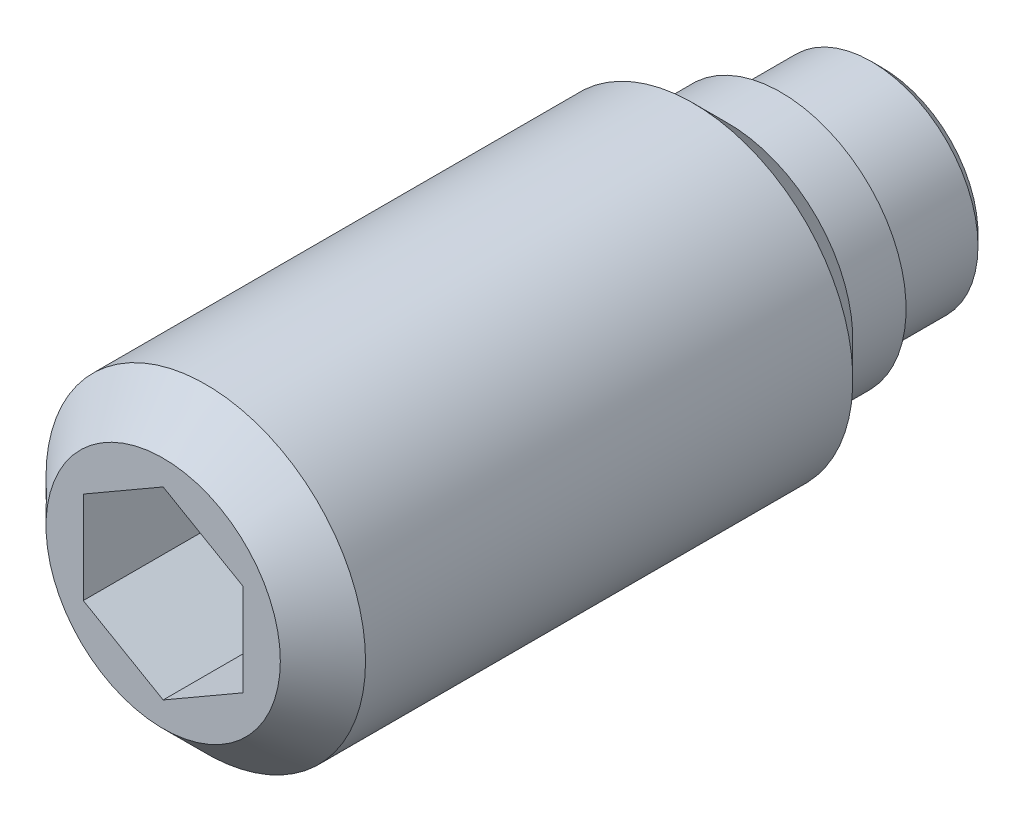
ISO-10303-21;
HEADER;
FILE_DESCRIPTION(('STEP AP214'),'2;1');
FILE_NAME('part.step','',(''),(''),'','','');
FILE_SCHEMA(('AUTOMOTIVE_DESIGN { 1 0 10303 214 1 1 1 1 }'));
ENDSEC;
DATA;
#1=APPLICATION_CONTEXT('core data for automotive mechanical design processes');
#2=APPLICATION_PROTOCOL_DEFINITION('international standard','automotive_design',2000,#1);
#3=PRODUCT_CONTEXT('',#1,'mechanical');
#4=PRODUCT('Part','Part','',(#3));
#5=PRODUCT_RELATED_PRODUCT_CATEGORY('part','',(#4));
#6=PRODUCT_DEFINITION_FORMATION('','',#4);
#7=PRODUCT_DEFINITION_CONTEXT('part definition',#1,'design');
#8=PRODUCT_DEFINITION('design','',#6,#7);
#9=PRODUCT_DEFINITION_SHAPE('','',#8);
#10=(LENGTH_UNIT() NAMED_UNIT(*) SI_UNIT(.MILLI.,.METRE.));
#11=(NAMED_UNIT(*) PLANE_ANGLE_UNIT() SI_UNIT($,.RADIAN.));
#12=(NAMED_UNIT(*) SI_UNIT($,.STERADIAN.) SOLID_ANGLE_UNIT());
#13=UNCERTAINTY_MEASURE_WITH_UNIT(LENGTH_MEASURE(1.E-05),#10,'distance_accuracy_value','');
#14=(GEOMETRIC_REPRESENTATION_CONTEXT(3) GLOBAL_UNCERTAINTY_ASSIGNED_CONTEXT((#13)) GLOBAL_UNIT_ASSIGNED_CONTEXT((#10,
#11,#12)) REPRESENTATION_CONTEXT('',''));
#15=CARTESIAN_POINT('',(0.,0.,0.));
#16=DIRECTION('',(0.,0.,1.));
#17=DIRECTION('',(1.,0.,0.));
#18=AXIS2_PLACEMENT_3D('',#15,#16,#17);
#19=CARTESIAN_POINT('',(0.,0.,1.9));
#20=DIRECTION('',(0.,0.,-1.));
#21=DIRECTION('',(-1.,0.,0.));
#22=AXIS2_PLACEMENT_3D('',#19,#20,#21);
#23=CYLINDRICAL_SURFACE('',#22,3.);
#24=CARTESIAN_POINT('',(0.,0.,12.7));
#25=DIRECTION('',(0.,0.,1.));
#26=DIRECTION('',(1.,0.,0.));
#27=AXIS2_PLACEMENT_3D('',#24,#25,#26);
#28=CIRCLE('',#27,3.);
#29=CARTESIAN_POINT('',(3.,0.,12.7));
#30=VERTEX_POINT('',#29);
#31=EDGE_CURVE('E9',#30,#30,#28,.F.);
#32=ORIENTED_EDGE('',*,*,#31,.T.);
#33=EDGE_LOOP('',(#32));
#34=FACE_BOUND('',#33,.T.);
#35=CARTESIAN_POINT('',(0.,0.,3.55));
#36=DIRECTION('',(0.,0.,-1.));
#37=DIRECTION('',(-1.,0.,0.));
#38=AXIS2_PLACEMENT_3D('',#35,#36,#37);
#39=CIRCLE('',#38,3.);
#40=CARTESIAN_POINT('',(-3.,0.,3.55));
#41=VERTEX_POINT('',#40);
#42=EDGE_CURVE('E74',#41,#41,#39,.T.);
#43=ORIENTED_EDGE('',*,*,#42,.F.);
#44=EDGE_LOOP('',(#43));
#45=FACE_BOUND('',#44,.T.);
#46=ADVANCED_FACE('F14',(#34,#45),#23,.T.);
#47=CARTESIAN_POINT('',(0.,0.,3.55));
#48=DIRECTION('',(0.,0.,1.));
#49=DIRECTION('',(1.,0.,0.));
#50=AXIS2_PLACEMENT_3D('',#47,#48,#49);
#51=CONICAL_SURFACE('',#50,3.,0.785398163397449);
#52=ORIENTED_EDGE('',*,*,#42,.T.);
#53=EDGE_LOOP('',(#52));
#54=FACE_BOUND('',#53,.T.);
#55=CARTESIAN_POINT('',(0.,0.,2.9));
#56=DIRECTION('',(0.,0.,-1.));
#57=DIRECTION('',(-1.,0.,0.));
#58=AXIS2_PLACEMENT_3D('',#55,#56,#57);
#59=CIRCLE('',#58,2.35);
#60=CARTESIAN_POINT('',(-2.35,0.,2.9));
#61=VERTEX_POINT('',#60);
#62=EDGE_CURVE('E112',#61,#61,#59,.T.);
#63=ORIENTED_EDGE('',*,*,#62,.F.);
#64=EDGE_LOOP('',(#63));
#65=FACE_BOUND('',#64,.T.);
#66=ADVANCED_FACE('F130',(#54,#65),#51,.T.);
#67=CARTESIAN_POINT('',(0.,0.,1.9));
#68=DIRECTION('',(0.,0.,-1.));
#69=DIRECTION('',(-1.,0.,0.));
#70=AXIS2_PLACEMENT_3D('',#67,#68,#69);
#71=CYLINDRICAL_SURFACE('',#70,2.35);
#72=ORIENTED_EDGE('',*,*,#62,.T.);
#73=EDGE_LOOP('',(#72));
#74=FACE_BOUND('',#73,.T.);
#75=CARTESIAN_POINT('',(0.,0.,1.9));
#76=DIRECTION('',(0.,0.,-1.));
#77=DIRECTION('',(-1.,0.,0.));
#78=AXIS2_PLACEMENT_3D('',#75,#76,#77);
#79=CIRCLE('',#78,2.35);
#80=CARTESIAN_POINT('',(-2.35,0.,1.9));
#81=VERTEX_POINT('',#80);
#82=EDGE_CURVE('E109',#81,#81,#79,.T.);
#83=ORIENTED_EDGE('',*,*,#82,.F.);
#84=EDGE_LOOP('',(#83));
#85=FACE_BOUND('',#84,.T.);
#86=ADVANCED_FACE('F135',(#74,#85),#71,.T.);
#87=CARTESIAN_POINT('',(0.,2.35,1.9));
#88=DIRECTION('',(0.,0.,1.));
#89=DIRECTION('',(1.,0.,0.));
#90=AXIS2_PLACEMENT_3D('',#87,#88,#89);
#91=PLANE('',#90);
#92=ORIENTED_EDGE('',*,*,#82,.T.);
#93=EDGE_LOOP('',(#92));
#94=FACE_BOUND('',#93,.T.);
#95=CARTESIAN_POINT('',(0.,0.,1.9));
#96=DIRECTION('',(0.,0.,-1.));
#97=DIRECTION('',(-1.,0.,0.));
#98=AXIS2_PLACEMENT_3D('',#95,#96,#97);
#99=CIRCLE('',#98,2.);
#100=CARTESIAN_POINT('',(-2.,0.,1.9));
#101=VERTEX_POINT('',#100);
#102=EDGE_CURVE('E106',#101,#101,#99,.T.);
#103=ORIENTED_EDGE('',*,*,#102,.F.);
#104=EDGE_LOOP('',(#103));
#105=FACE_BOUND('',#104,.T.);
#106=ADVANCED_FACE('F142',(#94,#105),#91,.F.);
#107=CARTESIAN_POINT('',(0.,0.,0.));
#108=DIRECTION('',(0.,0.,-1.));
#109=DIRECTION('',(-1.,0.,0.));
#110=AXIS2_PLACEMENT_3D('',#107,#108,#109);
#111=CYLINDRICAL_SURFACE('',#110,2.);
#112=CARTESIAN_POINT('',(0.,0.,0.2));
#113=DIRECTION('',(0.,0.,-1.));
#114=DIRECTION('',(-1.,0.,0.));
#115=AXIS2_PLACEMENT_3D('',#112,#113,#114);
#116=CIRCLE('',#115,2.);
#117=CARTESIAN_POINT('',(-2.,0.,0.2));
#118=VERTEX_POINT('',#117);
#119=EDGE_CURVE('E103',#118,#118,#116,.T.);
#120=ORIENTED_EDGE('',*,*,#119,.F.);
#121=EDGE_LOOP('',(#120));
#122=FACE_BOUND('',#121,.T.);
#123=ORIENTED_EDGE('',*,*,#102,.T.);
#124=EDGE_LOOP('',(#123));
#125=FACE_BOUND('',#124,.T.);
#126=ADVANCED_FACE('F146',(#122,#125),#111,.T.);
#127=CARTESIAN_POINT('',(0.,0.,0.2));
#128=DIRECTION('',(0.,0.,1.));
#129=DIRECTION('',(1.,0.,0.));
#130=AXIS2_PLACEMENT_3D('',#127,#128,#129);
#131=CONICAL_SURFACE('',#130,2.,0.785398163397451);
#132=CARTESIAN_POINT('',(0.,0.,0.));
#133=DIRECTION('',(0.,0.,-1.));
#134=DIRECTION('',(-1.,0.,0.));
#135=AXIS2_PLACEMENT_3D('',#132,#133,#134);
#136=CIRCLE('',#135,1.8);
#137=CARTESIAN_POINT('',(-1.8,0.,0.));
#138=VERTEX_POINT('',#137);
#139=EDGE_CURVE('E100',#138,#138,#136,.T.);
#140=ORIENTED_EDGE('',*,*,#139,.F.);
#141=EDGE_LOOP('',(#140));
#142=FACE_BOUND('',#141,.T.);
#143=ORIENTED_EDGE('',*,*,#119,.T.);
#144=EDGE_LOOP('',(#143));
#145=FACE_BOUND('',#144,.T.);
#146=ADVANCED_FACE('F150',(#142,#145),#131,.T.);
#147=CARTESIAN_POINT('',(0.,1.8,0.));
#148=DIRECTION('',(0.,0.,1.));
#149=DIRECTION('',(1.,0.,0.));
#150=AXIS2_PLACEMENT_3D('',#147,#148,#149);
#151=PLANE('',#150);
#152=ORIENTED_EDGE('',*,*,#139,.T.);
#153=EDGE_LOOP('',(#152));
#154=FACE_BOUND('',#153,.T.);
#155=ADVANCED_FACE('F154',(#154),#151,.F.);
#156=CARTESIAN_POINT('',(0.,0.,13.5));
#157=DIRECTION('',(0.,0.,1.));
#158=DIRECTION('',(1.,0.,0.));
#159=AXIS2_PLACEMENT_3D('',#156,#157,#158);
#160=PLANE('',#159);
#161=CARTESIAN_POINT('',(0.,0.,13.5));
#162=DIRECTION('',(0.,0.,1.));
#163=DIRECTION('',(1.,0.,0.));
#164=AXIS2_PLACEMENT_3D('',#161,#162,#163);
#165=CIRCLE('',#164,2.2);
#166=CARTESIAN_POINT('',(2.2,0.,13.5));
#167=VERTEX_POINT('',#166);
#168=EDGE_CURVE('E22',#167,#167,#165,.T.);
#169=ORIENTED_EDGE('',*,*,#168,.T.);
#170=EDGE_LOOP('',(#169));
#171=FACE_BOUND('',#170,.T.);
#172=DIRECTION('',(-0.866025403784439,0.5,0.));
#173=VECTOR('',#172,1.);
#174=CARTESIAN_POINT('',(-1.5,-0.866025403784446,13.5));
#175=LINE('',#174,#173);
#176=CARTESIAN_POINT('',(0.,-1.73205080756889,13.5));
#177=VERTEX_POINT('',#176);
#178=CARTESIAN_POINT('',(-1.5,-0.866025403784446,13.5));
#179=VERTEX_POINT('',#178);
#180=EDGE_CURVE('E69',#177,#179,#175,.T.);
#181=ORIENTED_EDGE('',*,*,#180,.T.);
#182=DIRECTION('',(0.,1.,0.));
#183=VECTOR('',#182,1.);
#184=CARTESIAN_POINT('',(-1.5,0.866025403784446,13.5));
#185=LINE('',#184,#183);
#186=CARTESIAN_POINT('',(-1.5,0.866025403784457,13.5));
#187=VERTEX_POINT('',#186);
#188=EDGE_CURVE('E84',#179,#187,#185,.T.);
#189=ORIENTED_EDGE('',*,*,#188,.T.);
#190=DIRECTION('',(0.866025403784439,0.5,0.));
#191=VECTOR('',#190,1.);
#192=CARTESIAN_POINT('',(0.,1.73205080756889,13.5));
#193=LINE('',#192,#191);
#194=CARTESIAN_POINT('',(0.,1.73205080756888,13.5));
#195=VERTEX_POINT('',#194);
#196=EDGE_CURVE('E301',#187,#195,#193,.T.);
#197=ORIENTED_EDGE('',*,*,#196,.T.);
#198=DIRECTION('',(0.866025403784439,-0.5,0.));
#199=VECTOR('',#198,1.);
#200=CARTESIAN_POINT('',(1.5,0.866025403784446,13.5));
#201=LINE('',#200,#199);
#202=CARTESIAN_POINT('',(1.5,0.866025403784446,13.5));
#203=VERTEX_POINT('',#202);
#204=EDGE_CURVE('E298',#195,#203,#201,.T.);
#205=ORIENTED_EDGE('',*,*,#204,.T.);
#206=DIRECTION('',(0.,-1.,0.));
#207=VECTOR('',#206,1.);
#208=CARTESIAN_POINT('',(1.5,-0.866025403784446,13.5));
#209=LINE('',#208,#207);
#210=CARTESIAN_POINT('',(1.5,-0.866025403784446,13.5));
#211=VERTEX_POINT('',#210);
#212=EDGE_CURVE('E29',#203,#211,#209,.T.);
#213=ORIENTED_EDGE('',*,*,#212,.T.);
#214=DIRECTION('',(-0.866025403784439,-0.5,0.));
#215=VECTOR('',#214,1.);
#216=CARTESIAN_POINT('',(0.,-1.73205080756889,13.5));
#217=LINE('',#216,#215);
#218=EDGE_CURVE('E66',#211,#177,#217,.T.);
#219=ORIENTED_EDGE('',*,*,#218,.T.);
#220=EDGE_LOOP('',(#181,#189,#197,#205,#213,#219));
#221=FACE_BOUND('',#220,.T.);
#222=ADVANCED_FACE('F68',(#171,#221),#160,.T.);
#223=CARTESIAN_POINT('',(0.,0.,10.));
#224=DIRECTION('',(0.,0.,1.));
#225=DIRECTION('',(1.,0.,0.));
#226=AXIS2_PLACEMENT_3D('',#223,#224,#225);
#227=PLANE('',#226);
#228=DIRECTION('',(0.,-1.,0.));
#229=VECTOR('',#228,1.);
#230=CARTESIAN_POINT('',(-1.5,0.866025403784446,10.));
#231=LINE('',#230,#229);
#232=CARTESIAN_POINT('',(-1.5,0.866025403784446,10.));
#233=VERTEX_POINT('',#232);
#234=CARTESIAN_POINT('',(-1.5,-0.866025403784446,10.));
#235=VERTEX_POINT('',#234);
#236=EDGE_CURVE('E83',#233,#235,#231,.T.);
#237=ORIENTED_EDGE('',*,*,#236,.T.);
#238=DIRECTION('',(0.866025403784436,-0.5,0.));
#239=VECTOR('',#238,1.);
#240=CARTESIAN_POINT('',(-1.5,-0.866025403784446,10.));
#241=LINE('',#240,#239);
#242=CARTESIAN_POINT('',(0.,-1.73205080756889,10.));
#243=VERTEX_POINT('',#242);
#244=EDGE_CURVE('E280',#235,#243,#241,.T.);
#245=ORIENTED_EDGE('',*,*,#244,.T.);
#246=DIRECTION('',(0.866025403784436,0.5,0.));
#247=VECTOR('',#246,1.);
#248=CARTESIAN_POINT('',(0.,-1.73205080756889,10.));
#249=LINE('',#248,#247);
#250=CARTESIAN_POINT('',(1.5,-0.866025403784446,10.));
#251=VERTEX_POINT('',#250);
#252=EDGE_CURVE('E88',#243,#251,#249,.T.);
#253=ORIENTED_EDGE('',*,*,#252,.T.);
#254=DIRECTION('',(0.,1.,0.));
#255=VECTOR('',#254,1.);
#256=CARTESIAN_POINT('',(1.5,-0.866025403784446,10.));
#257=LINE('',#256,#255);
#258=CARTESIAN_POINT('',(1.5,0.866025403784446,10.));
#259=VERTEX_POINT('',#258);
#260=EDGE_CURVE('E287',#251,#259,#257,.T.);
#261=ORIENTED_EDGE('',*,*,#260,.T.);
#262=DIRECTION('',(-0.866025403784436,0.5,0.));
#263=VECTOR('',#262,1.);
#264=CARTESIAN_POINT('',(1.5,0.866025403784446,10.));
#265=LINE('',#264,#263);
#266=CARTESIAN_POINT('',(0.,1.73205080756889,10.));
#267=VERTEX_POINT('',#266);
#268=EDGE_CURVE('E96',#259,#267,#265,.T.);
#269=ORIENTED_EDGE('',*,*,#268,.T.);
#270=DIRECTION('',(-0.866025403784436,-0.5,0.));
#271=VECTOR('',#270,1.);
#272=CARTESIAN_POINT('',(0.,1.73205080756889,10.));
#273=LINE('',#272,#271);
#274=EDGE_CURVE('E91',#267,#233,#273,.T.);
#275=ORIENTED_EDGE('',*,*,#274,.T.);
#276=EDGE_LOOP('',(#237,#245,#253,#261,#269,#275));
#277=FACE_BOUND('',#276,.T.);
#278=ADVANCED_FACE('F162',(#277),#227,.T.);
#279=CARTESIAN_POINT('',(0.,-1.73205080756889,14.));
#280=DIRECTION('',(0.5,-0.866025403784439,0.));
#281=DIRECTION('',(0.866025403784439,0.5,0.));
#282=AXIS2_PLACEMENT_3D('',#279,#280,#281);
#283=PLANE('',#282);
#284=ORIENTED_EDGE('',*,*,#218,.F.);
#285=DIRECTION('',(0.,0.,1.));
#286=VECTOR('',#285,1.);
#287=CARTESIAN_POINT('',(1.5,-0.866025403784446,14.));
#288=LINE('',#287,#286);
#289=EDGE_CURVE('E90',#251,#211,#288,.T.);
#290=ORIENTED_EDGE('',*,*,#289,.F.);
#291=ORIENTED_EDGE('',*,*,#252,.F.);
#292=DIRECTION('',(0.,0.,1.));
#293=VECTOR('',#292,1.);
#294=CARTESIAN_POINT('',(0.,-1.73205080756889,14.));
#295=LINE('',#294,#293);
#296=EDGE_CURVE('E80',#243,#177,#295,.T.);
#297=ORIENTED_EDGE('',*,*,#296,.T.);
#298=EDGE_LOOP('',(#284,#290,#291,#297));
#299=FACE_BOUND('',#298,.T.);
#300=ADVANCED_FACE('F86',(#299),#283,.F.);
#301=CARTESIAN_POINT('',(1.5,-0.866025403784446,14.));
#302=DIRECTION('',(1.,0.,0.));
#303=DIRECTION('',(0.,0.,-1.));
#304=AXIS2_PLACEMENT_3D('',#301,#302,#303);
#305=PLANE('',#304);
#306=ORIENTED_EDGE('',*,*,#212,.F.);
#307=DIRECTION('',(0.,0.,1.));
#308=VECTOR('',#307,1.);
#309=CARTESIAN_POINT('',(1.5,0.866025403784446,14.));
#310=LINE('',#309,#308);
#311=EDGE_CURVE('E93',#259,#203,#310,.T.);
#312=ORIENTED_EDGE('',*,*,#311,.F.);
#313=ORIENTED_EDGE('',*,*,#260,.F.);
#314=ORIENTED_EDGE('',*,*,#289,.T.);
#315=EDGE_LOOP('',(#306,#312,#313,#314));
#316=FACE_BOUND('',#315,.T.);
#317=ADVANCED_FACE('F161',(#316),#305,.F.);
#318=CARTESIAN_POINT('',(1.5,0.866025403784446,14.));
#319=DIRECTION('',(0.5,0.866025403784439,0.));
#320=DIRECTION('',(-0.866025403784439,0.5,0.));
#321=AXIS2_PLACEMENT_3D('',#318,#319,#320);
#322=PLANE('',#321);
#323=ORIENTED_EDGE('',*,*,#204,.F.);
#324=DIRECTION('',(0.,0.,1.));
#325=VECTOR('',#324,1.);
#326=CARTESIAN_POINT('',(0.,1.73205080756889,14.));
#327=LINE('',#326,#325);
#328=EDGE_CURVE('E293',#267,#195,#327,.T.);
#329=ORIENTED_EDGE('',*,*,#328,.F.);
#330=ORIENTED_EDGE('',*,*,#268,.F.);
#331=ORIENTED_EDGE('',*,*,#311,.T.);
#332=EDGE_LOOP('',(#323,#329,#330,#331));
#333=FACE_BOUND('',#332,.T.);
#334=ADVANCED_FACE('F165',(#333),#322,.F.);
#335=CARTESIAN_POINT('',(0.,1.73205080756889,14.));
#336=DIRECTION('',(-0.5,0.866025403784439,0.));
#337=DIRECTION('',(-0.866025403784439,-0.5,0.));
#338=AXIS2_PLACEMENT_3D('',#335,#336,#337);
#339=PLANE('',#338);
#340=ORIENTED_EDGE('',*,*,#196,.F.);
#341=DIRECTION('',(0.,0.,1.));
#342=VECTOR('',#341,1.);
#343=CARTESIAN_POINT('',(-1.5,0.866025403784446,14.));
#344=LINE('',#343,#342);
#345=EDGE_CURVE('E37',#233,#187,#344,.T.);
#346=ORIENTED_EDGE('',*,*,#345,.F.);
#347=ORIENTED_EDGE('',*,*,#274,.F.);
#348=ORIENTED_EDGE('',*,*,#328,.T.);
#349=EDGE_LOOP('',(#340,#346,#347,#348));
#350=FACE_BOUND('',#349,.T.);
#351=ADVANCED_FACE('F169',(#350),#339,.F.);
#352=CARTESIAN_POINT('',(-1.5,0.866025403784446,14.));
#353=DIRECTION('',(-1.,0.,0.));
#354=DIRECTION('',(0.,0.,1.));
#355=AXIS2_PLACEMENT_3D('',#352,#353,#354);
#356=PLANE('',#355);
#357=ORIENTED_EDGE('',*,*,#188,.F.);
#358=DIRECTION('',(0.,0.,1.));
#359=VECTOR('',#358,1.);
#360=CARTESIAN_POINT('',(-1.5,-0.866025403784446,14.));
#361=LINE('',#360,#359);
#362=EDGE_CURVE('E82',#235,#179,#361,.T.);
#363=ORIENTED_EDGE('',*,*,#362,.F.);
#364=ORIENTED_EDGE('',*,*,#236,.F.);
#365=ORIENTED_EDGE('',*,*,#345,.T.);
#366=EDGE_LOOP('',(#357,#363,#364,#365));
#367=FACE_BOUND('',#366,.T.);
#368=ADVANCED_FACE('F126',(#367),#356,.F.);
#369=CARTESIAN_POINT('',(-1.5,-0.866025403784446,14.));
#370=DIRECTION('',(-0.5,-0.866025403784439,0.));
#371=DIRECTION('',(0.866025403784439,-0.5,0.));
#372=AXIS2_PLACEMENT_3D('',#369,#370,#371);
#373=PLANE('',#372);
#374=ORIENTED_EDGE('',*,*,#180,.F.);
#375=ORIENTED_EDGE('',*,*,#296,.F.);
#376=ORIENTED_EDGE('',*,*,#244,.F.);
#377=ORIENTED_EDGE('',*,*,#362,.T.);
#378=EDGE_LOOP('',(#374,#375,#376,#377));
#379=FACE_BOUND('',#378,.T.);
#380=ADVANCED_FACE('F78',(#379),#373,.F.);
#381=CARTESIAN_POINT('',(0.,0.,13.5));
#382=DIRECTION('',(0.,0.,-1.));
#383=DIRECTION('',(-1.,0.,0.));
#384=AXIS2_PLACEMENT_3D('',#381,#382,#383);
#385=CONICAL_SURFACE('',#384,2.2,0.785398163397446);
#386=ORIENTED_EDGE('',*,*,#31,.F.);
#387=EDGE_LOOP('',(#386));
#388=FACE_BOUND('',#387,.T.);
#389=ORIENTED_EDGE('',*,*,#168,.F.);
#390=EDGE_LOOP('',(#389));
#391=FACE_BOUND('',#390,.T.);
#392=ADVANCED_FACE('F16',(#388,#391),#385,.T.);
#393=CLOSED_SHELL('',(#46,#66,#86,#106,#126,#146,#155,#222,#278,#300,#317,#334,#351,#368,#380,#392));
#394=MANIFOLD_SOLID_BREP('B1',#393);
#395=ADVANCED_BREP_SHAPE_REPRESENTATION('',(#18,#394),#14);
#396=SHAPE_DEFINITION_REPRESENTATION(#9,#395);
ENDSEC;
END-ISO-10303-21;
